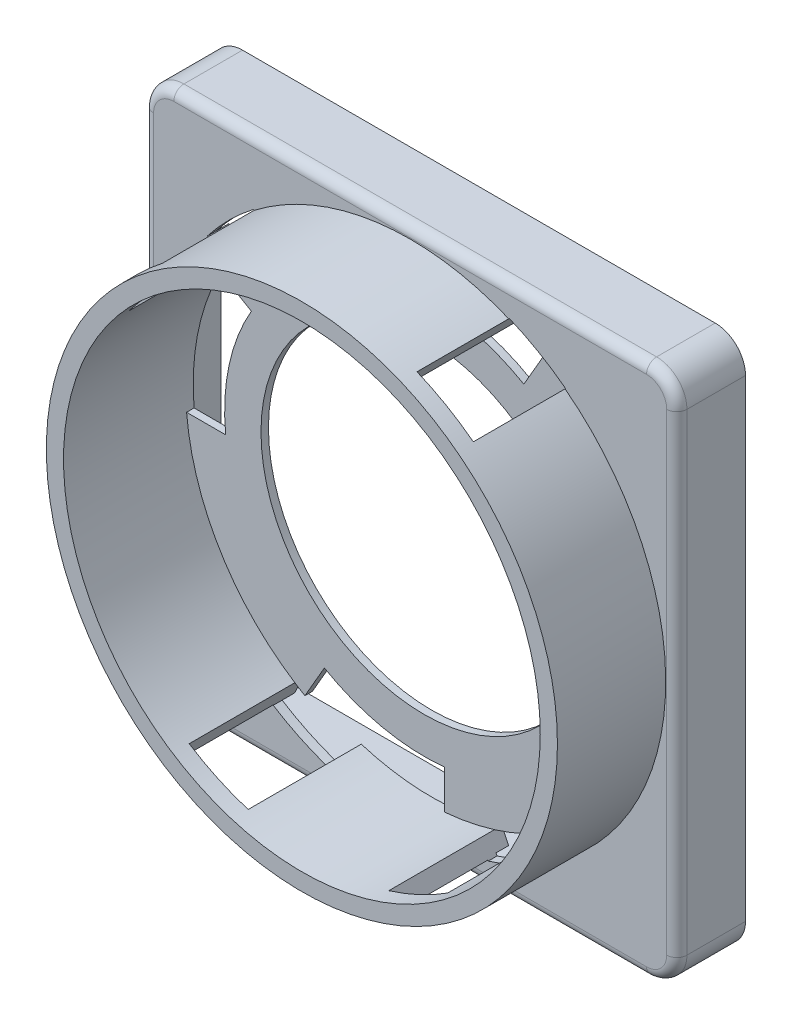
from build123d import *

# Parameters (mm, degrees)
BASE_EXTRUDE_DEPTH  = 8.636
SHELL1_T            = -1.1176
SKETCH2_R           = 32.131
BOSS_EXTRUDE1_DEPTH = 13.6144
SKETCH3_R           = 32.2326
BOSS_EXTRUDE2_DEPTH = 1.5748
CUT_EXTRUDE2_START  = -1.5748
CUT_EXTRUDE2_DEPTH  = 1.5748
SKETCH5_R           = 29.972
CUT_EXTRUDE3_DEPTH  = 15.367
SKETCH6_R           = 20.5105
CUT_EXTRUDE4_DEPTH  = 97.068511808
CUT_EXTRUDE5_DEPTH  = 97.068511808
CIRPATTERN1_COUNT   = 4
CUT_EXTRUDE6_START  = -14.224
CUT_EXTRUDE6_DEPTH  = 14.224
CUT_EXTRUDE7_START  = -14.224
CUT_EXTRUDE7_DEPTH  = 14.224
CUT_EXTRUDE8_START  = -14.224
CUT_EXTRUDE8_DEPTH  = 14.224
CIRPATTERN2_COUNT   = 2
CIRPATTERN2_ANGLE   = 310
FILLET1_R           = 1.27


with BuildPart() as part:
    # Sketch1 → Base-Extrude (new body)
    with BuildSketch(Plane.XY):
        with BuildLine():
            Line((3.81, 0), (63.246, 0))
            ThreePointArc((63.246, 0), (65.940076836, 1.115923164), (67.056, 3.81))
            Line((67.056, 3.81), (67.056, 63.246))
            ThreePointArc((67.056, 63.246), (65.940076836, 65.940076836), (63.246, 67.056))
            Line((63.246, 67.056), (3.81, 67.056))
            ThreePointArc((3.81, 67.056), (1.115923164, 65.940076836), (0, 63.246))
            Line((0, 63.246), (0, 3.81))
            ThreePointArc((0, 3.81), (1.115923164, 1.115923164), (3.81, 0))
        make_face()
    extrude(amount=-BASE_EXTRUDE_DEPTH)

    # Shell1
    shell1_openings = [part.faces().sort_by_distance(p)[0] for p in [
        (33.528, 33.528, -8.636),
    ]]
    offset(amount=SHELL1_T, openings=shell1_openings, kind=Kind.INTERSECTION)

    # Sketch2 → Boss-Extrude1 (add)
    with BuildSketch(Plane.XY):
        with Locations((33.528, 33.528)):
            Circle(SKETCH2_R)
    extrude(amount=BOSS_EXTRUDE1_DEPTH)

    # Sketch3 → Boss-Extrude2 (add)
    with BuildSketch(Plane(origin=(0, 0, -1.1176), x_dir=(-1, 0, 0), z_dir=(0, 0, -1))):
        with Locations(Location((-33.528, 33.528, 0), (0, 0, 180))):
            Circle(SKETCH3_R)
    extrude(amount=BOSS_EXTRUDE2_DEPTH)

    # Sketch4 → Cut-Extrude2 (cut)
    with BuildSketch(Plane(origin=(0, 0, -2.6924), x_dir=(-1, 0, 0), z_dir=(0, 0, -1)).offset(CUT_EXTRUDE2_START)):
        with BuildLine():
            Line((-63.246, 65.9384), (-3.81, 65.9384))
            ThreePointArc((-3.81, 65.9384), (-1.906185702, 65.149814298), (-1.1176, 63.246))
            Line((-1.1176, 63.246), (-1.1176, 3.81))
            ThreePointArc((-1.1176, 3.81), (-1.906185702, 1.906185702), (-3.81, 1.1176))
            Line((-3.81, 1.1176), (-63.246, 1.1176))
            ThreePointArc((-63.246, 1.1176), (-65.149814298, 1.906185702), (-65.9384, 3.81))
            Line((-65.9384, 3.81), (-65.9384, 63.246))
            ThreePointArc((-65.9384, 63.246), (-65.149814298, 65.149814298), (-63.246, 65.9384))
        make_face()
        with BuildLine():
            Line((-3.81, 63.9572), (-63.246, 63.9572))
            ThreePointArc((-63.246, 63.9572), (-63.748894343, 63.748894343), (-63.9572, 63.246))
            Line((-63.9572, 63.246), (-63.9572, 3.81))
            ThreePointArc((-63.9572, 3.81), (-63.748894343, 3.307105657), (-63.246, 3.0988))
            Line((-63.246, 3.0988), (-3.81, 3.0988))
            ThreePointArc((-3.81, 3.0988), (-3.307105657, 3.307105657), (-3.0988, 3.81))
            Line((-3.0988, 3.81), (-3.0988, 63.246))
            ThreePointArc((-3.0988, 63.246), (-3.307105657, 63.748894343), (-3.81, 63.9572))
        make_face(mode=Mode.SUBTRACT)
    extrude(amount=CUT_EXTRUDE2_DEPTH, mode=Mode.SUBTRACT)

    # Sketch5 → Cut-Extrude3 (cut)
    with BuildSketch(Plane.XY.offset(13.6144)):
        with Locations((33.528, 33.528)):
            Circle(SKETCH5_R)
    extrude(amount=-CUT_EXTRUDE3_DEPTH, mode=Mode.SUBTRACT)

    # Sketch6 → Cut-Extrude4 (cut, through all)
    with BuildSketch(Plane.XY.offset(-1.7526)):
        with Locations((33.528, 33.528)):
            Circle(SKETCH6_R)
    extrude(amount=-CUT_EXTRUDE4_DEPTH, mode=Mode.SUBTRACT)

    # Sketch7 → Cut-Extrude5 (cut, through all)
    with BuildSketch(Plane.XY.offset(-1.7526)):
        with BuildLine():
            Line((30.988, 63.392178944), (30.988, 58.481560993))
            ThreePointArc((30.988, 58.481560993), (38.783174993, 58.053801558), (46.06925, 55.25008219))
            Line((46.06925, 55.25008219), (48.514, 59.484513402))
            ThreePointArc((48.514, 59.484513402), (40.050514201, 62.781676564), (30.988, 63.392178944))
        make_face()
    cut_extrude5 = extrude(amount=-CUT_EXTRUDE5_DEPTH, mode=Mode.SUBTRACT)

    # CirPattern1: Cut-Extrude5 ×4 about axis
    cirpattern1_axis = Axis((33.528, 33.528, 0), (0, 0, 1))
    for i in range(1, CIRPATTERN1_COUNT):
        add(cut_extrude5.rotate(cirpattern1_axis, i * 360 / CIRPATTERN1_COUNT), mode=Mode.SUBTRACT)

    # Sketch8 → Cut-Extrude6 (cut)
    with BuildSketch(Plane(origin=(0, 0, -2.6924), x_dir=(-1, 0, 0), z_dir=(0, 0, -1)).offset(CUT_EXTRUDE6_START)):
        with BuildLine():
            Line((-45.972542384, 63.261379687), (-44.832330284, 61.286474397))
            ThreePointArc((-44.832330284, 61.286474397), (-48.514, 59.484513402), (-51.915378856, 57.197074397))
            Line((-51.915378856, 57.197074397), (-53.055590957, 59.171979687))
            ThreePointArc((-53.055590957, 59.171979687), (-49.6443, 61.44225043), (-45.972542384, 63.261379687))
        make_face()
    extrude(amount=CUT_EXTRUDE6_DEPTH, mode=Mode.SUBTRACT)

    # Sketch9 → Cut-Extrude7 (cut)
    with BuildSketch(Plane(origin=(0, 0, -2.6924), x_dir=(-1, 0, 0), z_dir=(0, 0, -1)).offset(CUT_EXTRUDE7_START)):
        with BuildLine():
            Line((-8.028645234, 53.244069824), (-9.641148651, 51.631566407))
            ThreePointArc((-9.641148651, 51.631566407), (-12.334595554, 54.721404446), (-15.424433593, 57.414851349))
            Line((-15.424433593, 57.414851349), (-13.811930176, 59.027354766))
            ThreePointArc((-13.811930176, 59.027354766), (-10.736109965, 56.319890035), (-8.028645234, 53.244069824))
        make_face()
    extrude(amount=CUT_EXTRUDE7_DEPTH, mode=Mode.SUBTRACT)

    # Sketch10 → Cut-Extrude8 (cut)
    with BuildSketch(Plane(origin=(0, 0, -2.6924), x_dir=(-1, 0, 0), z_dir=(0, 0, -1)).offset(CUT_EXTRUDE8_START)):
        with BuildLine():
            Line((-17.273486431, 8.346427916), (-16.309737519, 6.279661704))
            ThreePointArc((-16.309737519, 6.279661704), (-19.513159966, 4.501722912), (-22.897652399, 3.0988))
            Line((-22.897652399, 3.0988), (-23.85078467, 3.0988))
            Line((-23.85078467, 3.0988), (-24.68599656, 4.889917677))
            ThreePointArc((-24.68599656, 4.889917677), (-20.861285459, 6.364143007), (-17.273486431, 8.346427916))
        make_face()
    cut_extrude8 = extrude(amount=CUT_EXTRUDE8_DEPTH, mode=Mode.SUBTRACT)

    # CirPattern2: Cut-Extrude8 ×2 about axis
    cirpattern2_axis = Axis((33.528, 33.528, 0), (0, 0, -1))
    for i in range(1, CIRPATTERN2_COUNT):
        add(cut_extrude8.rotate(cirpattern2_axis, i * CIRPATTERN2_ANGLE / (CIRPATTERN2_COUNT - 1)), mode=Mode.SUBTRACT)

    # Fillet1
    fillet1_edges = [part.edges().sort_by_distance(p)[0] for p in [
        (33.528, 0, 0),
        (1.115923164, 1.115923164, 0),
        (0, 33.528, 0),
        (1.115923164, 65.940076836, 0),
        (33.528, 67.056, 0),
        (65.940076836, 65.940076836, 0),
        (67.056, 33.528, 0),
        (65.940076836, 1.115923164, 0),
    ]]
    fillet(fillet1_edges, radius=FILLET1_R)


solid = part.part
